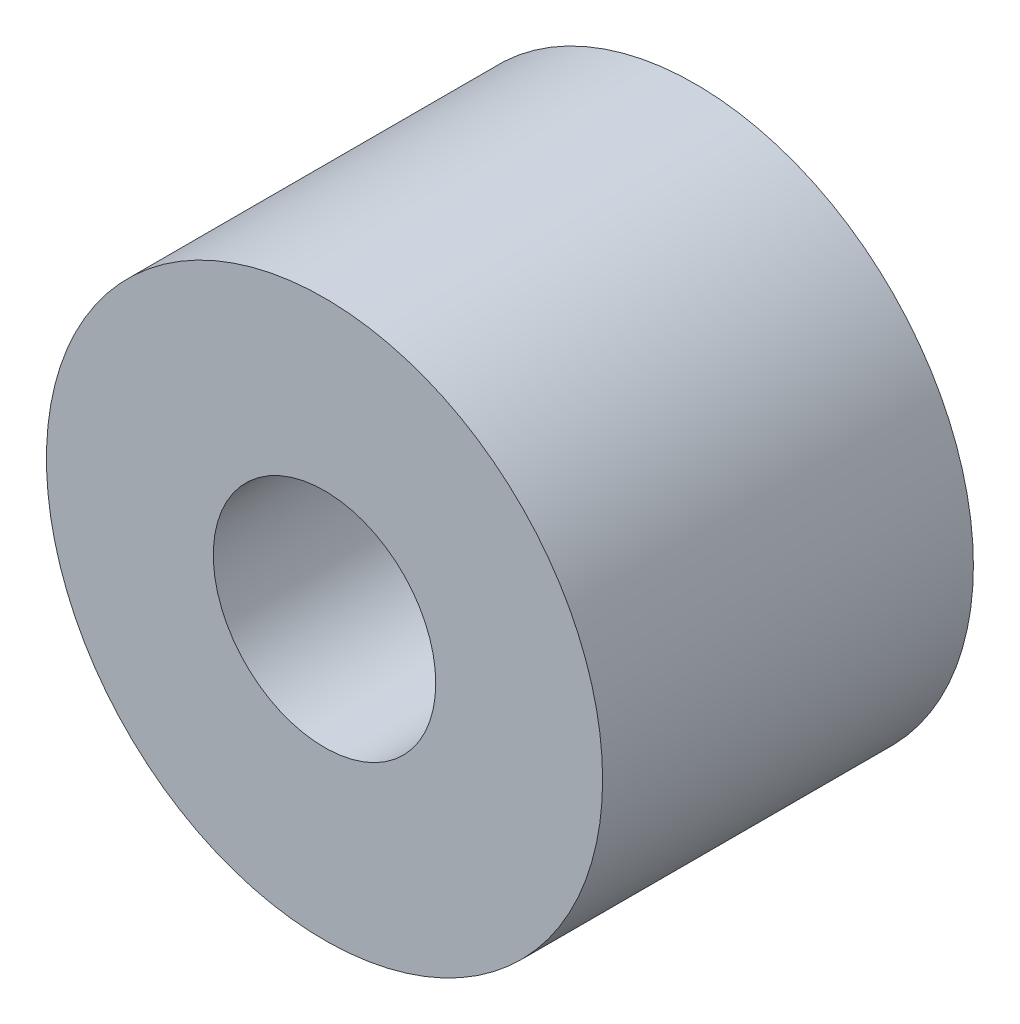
from build123d import *

# Parameters (mm, degrees)
SKETCH1_R          = 9.525
SKETCH1_R_2        = 3.81
BASE_EXTRUDE_DEPTH = 12.7


with BuildPart() as part:
    # Sketch1 → Base-Extrude (new body)
    with BuildSketch(Plane.XY):
        Circle(SKETCH1_R)
        Circle(SKETCH1_R_2, mode=Mode.SUBTRACT)
    extrude(amount=-BASE_EXTRUDE_DEPTH)


solid = part.part
